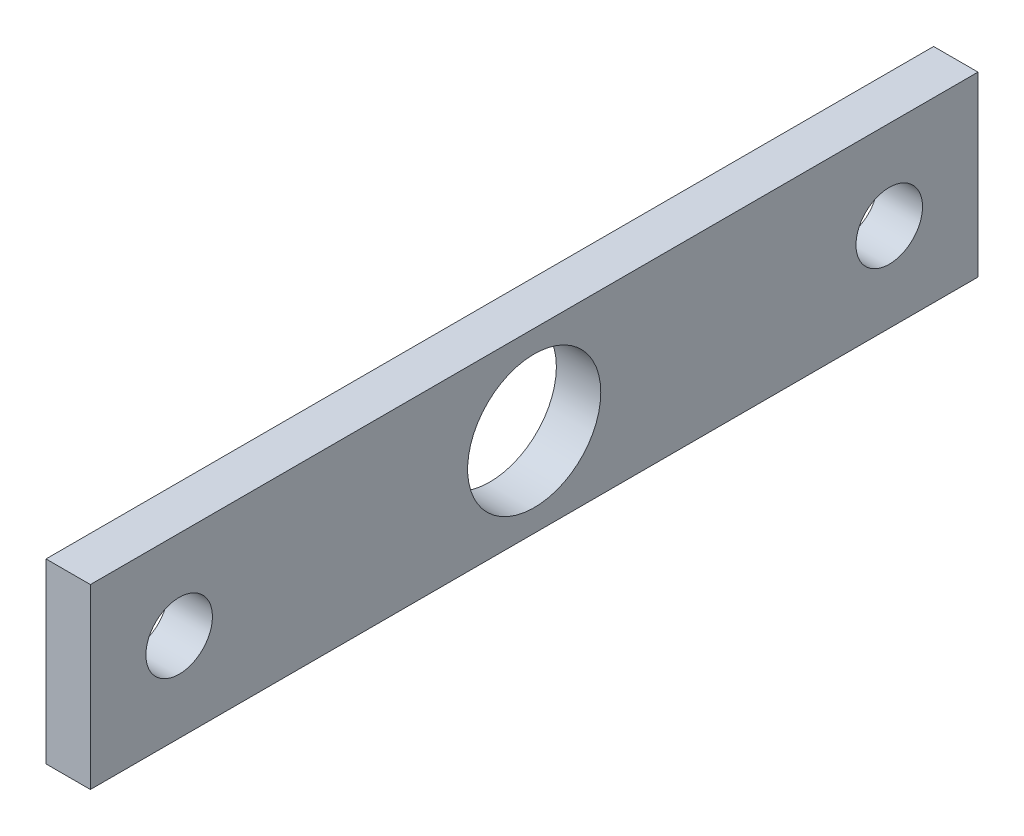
ISO-10303-21;
HEADER;
FILE_DESCRIPTION(('STEP AP214'),'2;1');
FILE_NAME('part.step','',(''),(''),'','','');
FILE_SCHEMA(('AUTOMOTIVE_DESIGN { 1 0 10303 214 1 1 1 1 }'));
ENDSEC;
DATA;
#1=APPLICATION_CONTEXT('core data for automotive mechanical design processes');
#2=APPLICATION_PROTOCOL_DEFINITION('international standard','automotive_design',2000,#1);
#3=PRODUCT_CONTEXT('',#1,'mechanical');
#4=PRODUCT('Part','Part','',(#3));
#5=PRODUCT_RELATED_PRODUCT_CATEGORY('part','',(#4));
#6=PRODUCT_DEFINITION_FORMATION('','',#4);
#7=PRODUCT_DEFINITION_CONTEXT('part definition',#1,'design');
#8=PRODUCT_DEFINITION('design','',#6,#7);
#9=PRODUCT_DEFINITION_SHAPE('','',#8);
#10=(LENGTH_UNIT() NAMED_UNIT(*) SI_UNIT(.MILLI.,.METRE.));
#11=(NAMED_UNIT(*) PLANE_ANGLE_UNIT() SI_UNIT($,.RADIAN.));
#12=(NAMED_UNIT(*) SI_UNIT($,.STERADIAN.) SOLID_ANGLE_UNIT());
#13=UNCERTAINTY_MEASURE_WITH_UNIT(LENGTH_MEASURE(1.E-05),#10,'distance_accuracy_value','');
#14=(GEOMETRIC_REPRESENTATION_CONTEXT(3) GLOBAL_UNCERTAINTY_ASSIGNED_CONTEXT((#13)) GLOBAL_UNIT_ASSIGNED_CONTEXT((#10,
#11,#12)) REPRESENTATION_CONTEXT('',''));
#15=CARTESIAN_POINT('',(0.,0.,0.));
#16=DIRECTION('',(0.,0.,1.));
#17=DIRECTION('',(1.,0.,0.));
#18=AXIS2_PLACEMENT_3D('',#15,#16,#17);
#19=CARTESIAN_POINT('',(3.175,0.,0.));
#20=DIRECTION('',(1.,0.,0.));
#21=DIRECTION('',(0.,0.,-1.));
#22=AXIS2_PLACEMENT_3D('',#19,#20,#21);
#23=PLANE('',#22);
#24=CARTESIAN_POINT('',(3.175,-6.34999999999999,-57.15));
#25=DIRECTION('',(1.,0.,0.));
#26=DIRECTION('',(0.,0.,-1.));
#27=AXIS2_PLACEMENT_3D('',#24,#25,#26);
#28=CIRCLE('',#27,2.38125000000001);
#29=CARTESIAN_POINT('',(3.175,-6.34999999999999,-59.53125));
#30=VERTEX_POINT('',#29);
#31=EDGE_CURVE('E117',#30,#30,#28,.T.);
#32=ORIENTED_EDGE('',*,*,#31,.F.);
#33=EDGE_LOOP('',(#32));
#34=FACE_BOUND('',#33,.T.);
#35=DIRECTION('',(0.,-1.,0.));
#36=VECTOR('',#35,1.);
#37=CARTESIAN_POINT('',(3.175,0.,0.));
#38=LINE('',#37,#36);
#39=CARTESIAN_POINT('',(3.175,0.,0.));
#40=VERTEX_POINT('',#39);
#41=CARTESIAN_POINT('',(3.175,-12.7,0.));
#42=VERTEX_POINT('',#41);
#43=EDGE_CURVE('E87',#40,#42,#38,.T.);
#44=ORIENTED_EDGE('',*,*,#43,.T.);
#45=DIRECTION('',(0.,0.,-1.));
#46=VECTOR('',#45,1.);
#47=CARTESIAN_POINT('',(3.175,-12.7,0.));
#48=LINE('',#47,#46);
#49=CARTESIAN_POINT('',(3.175,-12.7,-63.5));
#50=VERTEX_POINT('',#49);
#51=EDGE_CURVE('E82',#42,#50,#48,.T.);
#52=ORIENTED_EDGE('',*,*,#51,.T.);
#53=DIRECTION('',(0.,1.,0.));
#54=VECTOR('',#53,1.);
#55=CARTESIAN_POINT('',(3.175,0.,-63.5));
#56=LINE('',#55,#54);
#57=CARTESIAN_POINT('',(3.175,0.,-63.5));
#58=VERTEX_POINT('',#57);
#59=EDGE_CURVE('E85',#50,#58,#56,.T.);
#60=ORIENTED_EDGE('',*,*,#59,.T.);
#61=DIRECTION('',(0.,0.,1.));
#62=VECTOR('',#61,1.);
#63=CARTESIAN_POINT('',(3.175,0.,0.));
#64=LINE('',#63,#62);
#65=EDGE_CURVE('E52',#58,#40,#64,.T.);
#66=ORIENTED_EDGE('',*,*,#65,.T.);
#67=EDGE_LOOP('',(#44,#52,#60,#66));
#68=FACE_BOUND('',#67,.T.);
#69=CARTESIAN_POINT('',(3.175,-6.35,-6.34999999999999));
#70=DIRECTION('',(1.,0.,0.));
#71=DIRECTION('',(0.,0.,-1.));
#72=AXIS2_PLACEMENT_3D('',#69,#70,#71);
#73=CIRCLE('',#72,2.38125);
#74=CARTESIAN_POINT('',(3.175,-6.35,-8.73125));
#75=VERTEX_POINT('',#74);
#76=EDGE_CURVE('E102',#75,#75,#73,.T.);
#77=ORIENTED_EDGE('',*,*,#76,.F.);
#78=EDGE_LOOP('',(#77));
#79=FACE_BOUND('',#78,.T.);
#80=CARTESIAN_POINT('',(3.175,-6.35,-31.75));
#81=DIRECTION('',(1.,0.,0.));
#82=DIRECTION('',(0.,0.,-1.));
#83=AXIS2_PLACEMENT_3D('',#80,#81,#82);
#84=CIRCLE('',#83,4.7625);
#85=CARTESIAN_POINT('',(3.175,-6.35,-36.5125));
#86=VERTEX_POINT('',#85);
#87=EDGE_CURVE('E123',#86,#86,#84,.T.);
#88=ORIENTED_EDGE('',*,*,#87,.F.);
#89=EDGE_LOOP('',(#88));
#90=FACE_BOUND('',#89,.T.);
#91=ADVANCED_FACE('F35',(#34,#68,#79,#90),#23,.T.);
#92=CARTESIAN_POINT('',(0.,0.,0.));
#93=DIRECTION('',(1.,0.,0.));
#94=DIRECTION('',(0.,0.,-1.));
#95=AXIS2_PLACEMENT_3D('',#92,#93,#94);
#96=PLANE('',#95);
#97=DIRECTION('',(0.,-1.,0.));
#98=VECTOR('',#97,1.);
#99=CARTESIAN_POINT('',(0.,0.,0.));
#100=LINE('',#99,#98);
#101=CARTESIAN_POINT('',(0.,0.,0.));
#102=VERTEX_POINT('',#101);
#103=CARTESIAN_POINT('',(0.,-12.7,0.));
#104=VERTEX_POINT('',#103);
#105=EDGE_CURVE('E99',#102,#104,#100,.T.);
#106=ORIENTED_EDGE('',*,*,#105,.F.);
#107=DIRECTION('',(0.,0.,1.));
#108=VECTOR('',#107,1.);
#109=CARTESIAN_POINT('',(0.,0.,0.));
#110=LINE('',#109,#108);
#111=CARTESIAN_POINT('',(0.,0.,-63.5));
#112=VERTEX_POINT('',#111);
#113=EDGE_CURVE('E75',#112,#102,#110,.T.);
#114=ORIENTED_EDGE('',*,*,#113,.F.);
#115=DIRECTION('',(0.,1.,0.));
#116=VECTOR('',#115,1.);
#117=CARTESIAN_POINT('',(0.,0.,-63.5));
#118=LINE('',#117,#116);
#119=CARTESIAN_POINT('',(0.,-12.7,-63.5));
#120=VERTEX_POINT('',#119);
#121=EDGE_CURVE('E69',#120,#112,#118,.T.);
#122=ORIENTED_EDGE('',*,*,#121,.F.);
#123=DIRECTION('',(0.,0.,-1.));
#124=VECTOR('',#123,1.);
#125=CARTESIAN_POINT('',(0.,-12.7,0.));
#126=LINE('',#125,#124);
#127=EDGE_CURVE('E91',#104,#120,#126,.T.);
#128=ORIENTED_EDGE('',*,*,#127,.F.);
#129=EDGE_LOOP('',(#106,#114,#122,#128));
#130=FACE_BOUND('',#129,.T.);
#131=CARTESIAN_POINT('',(0.,-6.35,-6.34999999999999));
#132=DIRECTION('',(1.,0.,0.));
#133=DIRECTION('',(0.,0.,-1.));
#134=AXIS2_PLACEMENT_3D('',#131,#132,#133);
#135=CIRCLE('',#134,2.38125);
#136=CARTESIAN_POINT('',(0.,-6.35,-8.73125));
#137=VERTEX_POINT('',#136);
#138=EDGE_CURVE('E114',#137,#137,#135,.T.);
#139=ORIENTED_EDGE('',*,*,#138,.T.);
#140=EDGE_LOOP('',(#139));
#141=FACE_BOUND('',#140,.T.);
#142=CARTESIAN_POINT('',(0.,-6.34999999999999,-57.15));
#143=DIRECTION('',(1.,0.,0.));
#144=DIRECTION('',(0.,0.,-1.));
#145=AXIS2_PLACEMENT_3D('',#142,#143,#144);
#146=CIRCLE('',#145,2.38125000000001);
#147=CARTESIAN_POINT('',(0.,-6.34999999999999,-59.53125));
#148=VERTEX_POINT('',#147);
#149=EDGE_CURVE('E120',#148,#148,#146,.T.);
#150=ORIENTED_EDGE('',*,*,#149,.T.);
#151=EDGE_LOOP('',(#150));
#152=FACE_BOUND('',#151,.T.);
#153=CARTESIAN_POINT('',(0.,-6.35,-31.75));
#154=DIRECTION('',(1.,0.,0.));
#155=DIRECTION('',(0.,0.,-1.));
#156=AXIS2_PLACEMENT_3D('',#153,#154,#155);
#157=CIRCLE('',#156,4.7625);
#158=CARTESIAN_POINT('',(0.,-6.35,-36.5125));
#159=VERTEX_POINT('',#158);
#160=EDGE_CURVE('E126',#159,#159,#157,.T.);
#161=ORIENTED_EDGE('',*,*,#160,.T.);
#162=EDGE_LOOP('',(#161));
#163=FACE_BOUND('',#162,.T.);
#164=ADVANCED_FACE('F110',(#130,#141,#152,#163),#96,.F.);
#165=CARTESIAN_POINT('',(3.175,0.,0.));
#166=DIRECTION('',(0.,0.,-1.));
#167=DIRECTION('',(0.,1.,0.));
#168=AXIS2_PLACEMENT_3D('',#165,#166,#167);
#169=PLANE('',#168);
#170=ORIENTED_EDGE('',*,*,#105,.T.);
#171=DIRECTION('',(-1.,0.,0.));
#172=VECTOR('',#171,1.);
#173=CARTESIAN_POINT('',(3.175,-12.7,0.));
#174=LINE('',#173,#172);
#175=EDGE_CURVE('E11',#42,#104,#174,.T.);
#176=ORIENTED_EDGE('',*,*,#175,.F.);
#177=ORIENTED_EDGE('',*,*,#43,.F.);
#178=DIRECTION('',(-1.,0.,0.));
#179=VECTOR('',#178,1.);
#180=CARTESIAN_POINT('',(3.175,0.,0.));
#181=LINE('',#180,#179);
#182=EDGE_CURVE('E95',#40,#102,#181,.T.);
#183=ORIENTED_EDGE('',*,*,#182,.T.);
#184=EDGE_LOOP('',(#170,#176,#177,#183));
#185=FACE_BOUND('',#184,.T.);
#186=ADVANCED_FACE('F37',(#185),#169,.F.);
#187=CARTESIAN_POINT('',(3.175,-12.7,0.));
#188=DIRECTION('',(0.,1.,0.));
#189=DIRECTION('',(0.,0.,1.));
#190=AXIS2_PLACEMENT_3D('',#187,#188,#189);
#191=PLANE('',#190);
#192=ORIENTED_EDGE('',*,*,#127,.T.);
#193=DIRECTION('',(-1.,0.,0.));
#194=VECTOR('',#193,1.);
#195=CARTESIAN_POINT('',(3.175,-12.7,-63.5));
#196=LINE('',#195,#194);
#197=EDGE_CURVE('E44',#50,#120,#196,.T.);
#198=ORIENTED_EDGE('',*,*,#197,.F.);
#199=ORIENTED_EDGE('',*,*,#51,.F.);
#200=ORIENTED_EDGE('',*,*,#175,.T.);
#201=EDGE_LOOP('',(#192,#198,#199,#200));
#202=FACE_BOUND('',#201,.T.);
#203=ADVANCED_FACE('F90',(#202),#191,.F.);
#204=CARTESIAN_POINT('',(3.175,0.,-63.5));
#205=DIRECTION('',(0.,0.,1.));
#206=DIRECTION('',(1.,0.,0.));
#207=AXIS2_PLACEMENT_3D('',#204,#205,#206);
#208=PLANE('',#207);
#209=ORIENTED_EDGE('',*,*,#121,.T.);
#210=DIRECTION('',(-1.,0.,0.));
#211=VECTOR('',#210,1.);
#212=CARTESIAN_POINT('',(3.175,0.,-63.5));
#213=LINE('',#212,#211);
#214=EDGE_CURVE('E92',#58,#112,#213,.T.);
#215=ORIENTED_EDGE('',*,*,#214,.F.);
#216=ORIENTED_EDGE('',*,*,#59,.F.);
#217=ORIENTED_EDGE('',*,*,#197,.T.);
#218=EDGE_LOOP('',(#209,#215,#216,#217));
#219=FACE_BOUND('',#218,.T.);
#220=ADVANCED_FACE('F93',(#219),#208,.F.);
#221=CARTESIAN_POINT('',(3.175,0.,0.));
#222=DIRECTION('',(0.,-1.,0.));
#223=DIRECTION('',(0.,0.,-1.));
#224=AXIS2_PLACEMENT_3D('',#221,#222,#223);
#225=PLANE('',#224);
#226=ORIENTED_EDGE('',*,*,#113,.T.);
#227=ORIENTED_EDGE('',*,*,#182,.F.);
#228=ORIENTED_EDGE('',*,*,#65,.F.);
#229=ORIENTED_EDGE('',*,*,#214,.T.);
#230=EDGE_LOOP('',(#226,#227,#228,#229));
#231=FACE_BOUND('',#230,.T.);
#232=ADVANCED_FACE('F107',(#231),#225,.F.);
#233=CARTESIAN_POINT('',(3.175,-6.35,-6.34999999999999));
#234=DIRECTION('',(-1.,0.,0.));
#235=DIRECTION('',(0.,0.,1.));
#236=AXIS2_PLACEMENT_3D('',#233,#234,#235);
#237=CYLINDRICAL_SURFACE('',#236,2.38125);
#238=ORIENTED_EDGE('',*,*,#76,.T.);
#239=EDGE_LOOP('',(#238));
#240=FACE_BOUND('',#239,.T.);
#241=ORIENTED_EDGE('',*,*,#138,.F.);
#242=EDGE_LOOP('',(#241));
#243=FACE_BOUND('',#242,.T.);
#244=ADVANCED_FACE('F144',(#240,#243),#237,.F.);
#245=CARTESIAN_POINT('',(3.175,-6.34999999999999,-57.15));
#246=DIRECTION('',(-1.,0.,0.));
#247=DIRECTION('',(0.,0.,1.));
#248=AXIS2_PLACEMENT_3D('',#245,#246,#247);
#249=CYLINDRICAL_SURFACE('',#248,2.38125000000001);
#250=ORIENTED_EDGE('',*,*,#31,.T.);
#251=EDGE_LOOP('',(#250));
#252=FACE_BOUND('',#251,.T.);
#253=ORIENTED_EDGE('',*,*,#149,.F.);
#254=EDGE_LOOP('',(#253));
#255=FACE_BOUND('',#254,.T.);
#256=ADVANCED_FACE('F190',(#252,#255),#249,.F.);
#257=CARTESIAN_POINT('',(3.175,-6.35,-31.75));
#258=DIRECTION('',(-1.,0.,0.));
#259=DIRECTION('',(0.,0.,1.));
#260=AXIS2_PLACEMENT_3D('',#257,#258,#259);
#261=CYLINDRICAL_SURFACE('',#260,4.7625);
#262=ORIENTED_EDGE('',*,*,#87,.T.);
#263=EDGE_LOOP('',(#262));
#264=FACE_BOUND('',#263,.T.);
#265=ORIENTED_EDGE('',*,*,#160,.F.);
#266=EDGE_LOOP('',(#265));
#267=FACE_BOUND('',#266,.T.);
#268=ADVANCED_FACE('F132',(#264,#267),#261,.F.);
#269=CLOSED_SHELL('',(#91,#164,#186,#203,#220,#232,#244,#256,#268));
#270=MANIFOLD_SOLID_BREP('B2',#269);
#271=ADVANCED_BREP_SHAPE_REPRESENTATION('',(#18,#270),#14);
#272=SHAPE_DEFINITION_REPRESENTATION(#9,#271);
ENDSEC;
END-ISO-10303-21;
